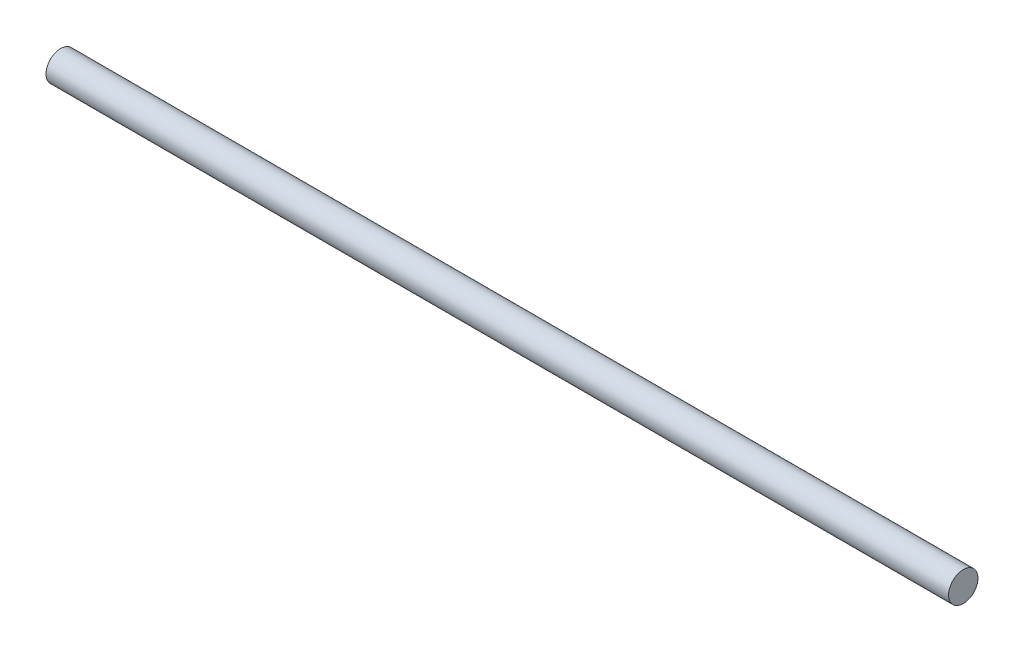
from build123d import *

# Parameters (mm, degrees)
SKETCH1_R           = 2.38125
BOSS_EXTRUDE1_DEPTH = 73.025


with BuildPart() as part:
    # Sketch1 → Boss-Extrude1 (new, symmetric)
    with BuildSketch(Plane(origin=(0, 0, 0), x_dir=(0, 0, -1), z_dir=(1, 0, 0))):
        Circle(SKETCH1_R)
    extrude(amount=BOSS_EXTRUDE1_DEPTH, both=True)


solid = part.part
